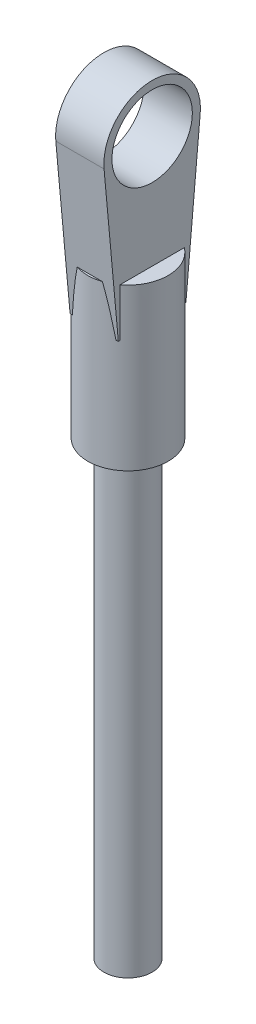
ISO-10303-21;
HEADER;
FILE_DESCRIPTION(('STEP AP214'),'2;1');
FILE_NAME('part.step','',(''),(''),'','','');
FILE_SCHEMA(('AUTOMOTIVE_DESIGN { 1 0 10303 214 1 1 1 1 }'));
ENDSEC;
DATA;
#1=APPLICATION_CONTEXT('core data for automotive mechanical design processes');
#2=APPLICATION_PROTOCOL_DEFINITION('international standard','automotive_design',2000,#1);
#3=PRODUCT_CONTEXT('',#1,'mechanical');
#4=PRODUCT('Part','Part','',(#3));
#5=PRODUCT_RELATED_PRODUCT_CATEGORY('part','',(#4));
#6=PRODUCT_DEFINITION_FORMATION('','',#4);
#7=PRODUCT_DEFINITION_CONTEXT('part definition',#1,'design');
#8=PRODUCT_DEFINITION('design','',#6,#7);
#9=PRODUCT_DEFINITION_SHAPE('','',#8);
#10=(LENGTH_UNIT() NAMED_UNIT(*) SI_UNIT(.MILLI.,.METRE.));
#11=(NAMED_UNIT(*) PLANE_ANGLE_UNIT() SI_UNIT($,.RADIAN.));
#12=(NAMED_UNIT(*) SI_UNIT($,.STERADIAN.) SOLID_ANGLE_UNIT());
#13=UNCERTAINTY_MEASURE_WITH_UNIT(LENGTH_MEASURE(1.E-05),#10,'distance_accuracy_value','');
#14=(GEOMETRIC_REPRESENTATION_CONTEXT(3) GLOBAL_UNCERTAINTY_ASSIGNED_CONTEXT((#13)) GLOBAL_UNIT_ASSIGNED_CONTEXT((#10,
#11,#12)) REPRESENTATION_CONTEXT('',''));
#15=CARTESIAN_POINT('',(0.,0.,0.));
#16=DIRECTION('',(0.,0.,1.));
#17=DIRECTION('',(1.,0.,0.));
#18=AXIS2_PLACEMENT_3D('',#15,#16,#17);
#19=CARTESIAN_POINT('',(0.,10.,0.));
#20=DIRECTION('',(0.,1.,0.));
#21=DIRECTION('',(0.,0.,1.));
#22=AXIS2_PLACEMENT_3D('',#19,#20,#21);
#23=PLANE('',#22);
#24=DIRECTION('',(-1.,0.,0.));
#25=VECTOR('',#24,1.);
#26=CARTESIAN_POINT('',(0.,10.,-2.37373888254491));
#27=LINE('',#26,#25);
#28=CARTESIAN_POINT('',(0.784451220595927,10.,-2.37373888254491));
#29=VERTEX_POINT('',#28);
#30=CARTESIAN_POINT('',(-0.784451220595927,10.,-2.37373888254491));
#31=VERTEX_POINT('',#30);
#32=EDGE_CURVE('E219',#29,#31,#27,.T.);
#33=ORIENTED_EDGE('',*,*,#32,.F.);
#34=CARTESIAN_POINT('',(0.,10.,0.));
#35=DIRECTION('',(0.,1.,0.));
#36=DIRECTION('',(0.,0.,1.));
#37=AXIS2_PLACEMENT_3D('',#34,#35,#36);
#38=CIRCLE('',#37,2.5);
#39=EDGE_CURVE('E439',#29,#31,#38,.T.);
#40=ORIENTED_EDGE('',*,*,#39,.T.);
#41=EDGE_LOOP('',(#33,#40));
#42=FACE_BOUND('',#41,.T.);
#43=ADVANCED_FACE('F36',(#42),#23,.T.);
#44=CARTESIAN_POINT('',(-1.5,10.,-2.));
#45=VERTEX_POINT('',#44);
#46=CARTESIAN_POINT('',(-1.5,10.,2.));
#47=VERTEX_POINT('',#46);
#48=EDGE_CURVE('E208',#45,#47,#38,.T.);
#49=ORIENTED_EDGE('',*,*,#48,.T.);
#50=DIRECTION('',(0.,0.,-1.));
#51=VECTOR('',#50,1.);
#52=CARTESIAN_POINT('',(-1.5,10.,0.));
#53=LINE('',#52,#51);
#54=EDGE_CURVE('E215',#47,#45,#53,.T.);
#55=ORIENTED_EDGE('',*,*,#54,.T.);
#56=EDGE_LOOP('',(#49,#55));
#57=FACE_BOUND('',#56,.T.);
#58=ADVANCED_FACE('F259',(#57),#23,.T.);
#59=DIRECTION('',(1.,0.,0.));
#60=VECTOR('',#59,1.);
#61=CARTESIAN_POINT('',(0.,10.,2.37373888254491));
#62=LINE('',#61,#60);
#63=CARTESIAN_POINT('',(-0.784451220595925,10.,2.37373888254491));
#64=VERTEX_POINT('',#63);
#65=CARTESIAN_POINT('',(0.784451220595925,10.,2.37373888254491));
#66=VERTEX_POINT('',#65);
#67=EDGE_CURVE('E217',#64,#66,#62,.T.);
#68=ORIENTED_EDGE('',*,*,#67,.F.);
#69=EDGE_CURVE('E205',#64,#66,#38,.T.);
#70=ORIENTED_EDGE('',*,*,#69,.T.);
#71=EDGE_LOOP('',(#68,#70));
#72=FACE_BOUND('',#71,.T.);
#73=ADVANCED_FACE('F266',(#72),#23,.T.);
#74=CARTESIAN_POINT('',(0.,10.,0.));
#75=DIRECTION('',(0.,-1.,0.));
#76=DIRECTION('',(0.,0.,-1.));
#77=AXIS2_PLACEMENT_3D('',#74,#75,#76);
#78=CYLINDRICAL_SURFACE('',#77,2.5);
#79=ORIENTED_EDGE('',*,*,#69,.F.);
#80=CARTESIAN_POINT('',(0.,-16.0146332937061,0.));
#81=DIRECTION('',(0.,-0.0908687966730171,0.995862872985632));
#82=DIRECTION('',(0.,-0.995862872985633,-0.0908687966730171));
#83=AXIS2_PLACEMENT_3D('',#80,#81,#82);
#84=ELLIPSE('',#83,27.5121944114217,2.5);
#85=CARTESIAN_POINT('',(-1.35646599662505,7.,2.1));
#86=VERTEX_POINT('',#85);
#87=EDGE_CURVE('E51',#64,#86,#84,.T.);
#88=ORIENTED_EDGE('',*,*,#87,.T.);
#89=CARTESIAN_POINT('',(0.,7.,0.));
#90=DIRECTION('',(0.,-1.,0.));
#91=DIRECTION('',(0.,0.,-1.));
#92=AXIS2_PLACEMENT_3D('',#89,#90,#91);
#93=CIRCLE('',#92,2.5);
#94=CARTESIAN_POINT('',(-1.5,7.,2.));
#95=VERTEX_POINT('',#94);
#96=EDGE_CURVE('E11',#86,#95,#93,.T.);
#97=ORIENTED_EDGE('',*,*,#96,.T.);
#98=DIRECTION('',(0.,-1.,0.));
#99=VECTOR('',#98,1.);
#100=CARTESIAN_POINT('',(-1.5,10.,2.));
#101=LINE('',#100,#99);
#102=EDGE_CURVE('E191',#47,#95,#101,.T.);
#103=ORIENTED_EDGE('',*,*,#102,.F.);
#104=ORIENTED_EDGE('',*,*,#48,.F.);
#105=DIRECTION('',(0.,-1.,0.));
#106=VECTOR('',#105,1.);
#107=CARTESIAN_POINT('',(-1.5,10.,-2.));
#108=LINE('',#107,#106);
#109=CARTESIAN_POINT('',(-1.5,7.,-2.));
#110=VERTEX_POINT('',#109);
#111=EDGE_CURVE('E188',#110,#45,#108,.F.);
#112=ORIENTED_EDGE('',*,*,#111,.F.);
#113=CARTESIAN_POINT('',(-1.35646599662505,7.,-2.1));
#114=VERTEX_POINT('',#113);
#115=EDGE_CURVE('E45',#110,#114,#93,.T.);
#116=ORIENTED_EDGE('',*,*,#115,.T.);
#117=CARTESIAN_POINT('',(0.,-16.0146332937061,0.));
#118=DIRECTION('',(0.,-0.0908687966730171,-0.995862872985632));
#119=DIRECTION('',(0.,-0.995862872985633,0.0908687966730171));
#120=AXIS2_PLACEMENT_3D('',#117,#118,#119);
#121=ELLIPSE('',#120,27.5121944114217,2.5);
#122=EDGE_CURVE('E197',#114,#31,#121,.T.);
#123=ORIENTED_EDGE('',*,*,#122,.T.);
#124=ORIENTED_EDGE('',*,*,#39,.F.);
#125=CARTESIAN_POINT('',(1.35646599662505,7.,-2.1));
#126=VERTEX_POINT('',#125);
#127=EDGE_CURVE('E195',#29,#126,#121,.T.);
#128=ORIENTED_EDGE('',*,*,#127,.T.);
#129=CARTESIAN_POINT('',(1.5,7.,-2.));
#130=VERTEX_POINT('',#129);
#131=EDGE_CURVE('E40',#126,#130,#93,.T.);
#132=ORIENTED_EDGE('',*,*,#131,.T.);
#133=DIRECTION('',(0.,-1.,0.));
#134=VECTOR('',#133,1.);
#135=CARTESIAN_POINT('',(1.5,10.,-2.));
#136=LINE('',#135,#134);
#137=CARTESIAN_POINT('',(1.5,10.,-2.));
#138=VERTEX_POINT('',#137);
#139=EDGE_CURVE('E177',#130,#138,#136,.F.);
#140=ORIENTED_EDGE('',*,*,#139,.T.);
#141=CARTESIAN_POINT('',(1.5,10.,2.));
#142=VERTEX_POINT('',#141);
#143=EDGE_CURVE('E209',#142,#138,#38,.T.);
#144=ORIENTED_EDGE('',*,*,#143,.F.);
#145=DIRECTION('',(0.,-1.,0.));
#146=VECTOR('',#145,1.);
#147=CARTESIAN_POINT('',(1.5,10.,2.));
#148=LINE('',#147,#146);
#149=CARTESIAN_POINT('',(1.5,7.,2.));
#150=VERTEX_POINT('',#149);
#151=EDGE_CURVE('E186',#142,#150,#148,.T.);
#152=ORIENTED_EDGE('',*,*,#151,.T.);
#153=CARTESIAN_POINT('',(1.35646599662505,7.,2.1));
#154=VERTEX_POINT('',#153);
#155=EDGE_CURVE('E222',#150,#154,#93,.T.);
#156=ORIENTED_EDGE('',*,*,#155,.T.);
#157=EDGE_CURVE('E194',#154,#66,#84,.T.);
#158=ORIENTED_EDGE('',*,*,#157,.T.);
#159=EDGE_LOOP('',(#79,#88,#97,#103,#104,#112,#116,#123,#124,#128,#132,#140,#144,#152,#156,#158));
#160=FACE_BOUND('',#159,.T.);
#161=CARTESIAN_POINT('',(0.,0.,0.));
#162=DIRECTION('',(0.,1.,0.));
#163=DIRECTION('',(0.,0.,1.));
#164=AXIS2_PLACEMENT_3D('',#161,#162,#163);
#165=CIRCLE('',#164,2.5);
#166=CARTESIAN_POINT('',(0.,0.,2.5));
#167=VERTEX_POINT('',#166);
#168=EDGE_CURVE('E201',#167,#167,#165,.T.);
#169=ORIENTED_EDGE('',*,*,#168,.T.);
#170=EDGE_LOOP('',(#169));
#171=FACE_BOUND('',#170,.T.);
#172=ADVANCED_FACE('F38',(#160,#171),#78,.T.);
#173=DIRECTION('',(0.,0.,-1.));
#174=VECTOR('',#173,1.);
#175=CARTESIAN_POINT('',(1.5,10.,0.));
#176=LINE('',#175,#174);
#177=EDGE_CURVE('E212',#142,#138,#176,.T.);
#178=ORIENTED_EDGE('',*,*,#177,.F.);
#179=ORIENTED_EDGE('',*,*,#143,.T.);
#180=EDGE_LOOP('',(#178,#179));
#181=FACE_BOUND('',#180,.T.);
#182=ADVANCED_FACE('F262',(#181),#23,.T.);
#183=CARTESIAN_POINT('',(0.,0.,0.));
#184=DIRECTION('',(0.,1.,0.));
#185=DIRECTION('',(0.,0.,1.));
#186=AXIS2_PLACEMENT_3D('',#183,#184,#185);
#187=PLANE('',#186);
#188=CARTESIAN_POINT('',(0.,0.,0.));
#189=DIRECTION('',(0.,1.,0.));
#190=DIRECTION('',(0.,0.,1.));
#191=AXIS2_PLACEMENT_3D('',#188,#189,#190);
#192=CIRCLE('',#191,1.5);
#193=CARTESIAN_POINT('',(0.,0.,1.5));
#194=VERTEX_POINT('',#193);
#195=EDGE_CURVE('E202',#194,#194,#192,.T.);
#196=ORIENTED_EDGE('',*,*,#195,.T.);
#197=EDGE_LOOP('',(#196));
#198=FACE_BOUND('',#197,.T.);
#199=ORIENTED_EDGE('',*,*,#168,.F.);
#200=EDGE_LOOP('',(#199));
#201=FACE_BOUND('',#200,.T.);
#202=ADVANCED_FACE('F270',(#198,#201),#187,.F.);
#203=CARTESIAN_POINT('',(0.,-28.,0.));
#204=DIRECTION('',(0.,1.,0.));
#205=DIRECTION('',(0.,0.,1.));
#206=AXIS2_PLACEMENT_3D('',#203,#204,#205);
#207=CYLINDRICAL_SURFACE('',#206,1.5);
#208=CARTESIAN_POINT('',(0.,-28.,0.));
#209=DIRECTION('',(0.,1.,0.));
#210=DIRECTION('',(0.,0.,1.));
#211=AXIS2_PLACEMENT_3D('',#208,#209,#210);
#212=CIRCLE('',#211,1.5);
#213=CARTESIAN_POINT('',(0.,-28.,1.5));
#214=VERTEX_POINT('',#213);
#215=EDGE_CURVE('E198',#214,#214,#212,.T.);
#216=ORIENTED_EDGE('',*,*,#215,.T.);
#217=EDGE_LOOP('',(#216));
#218=FACE_BOUND('',#217,.T.);
#219=ORIENTED_EDGE('',*,*,#195,.F.);
#220=EDGE_LOOP('',(#219));
#221=FACE_BOUND('',#220,.T.);
#222=ADVANCED_FACE('F276',(#218,#221),#207,.T.);
#223=CARTESIAN_POINT('',(0.,-28.,0.));
#224=DIRECTION('',(0.,1.,0.));
#225=DIRECTION('',(0.,0.,1.));
#226=AXIS2_PLACEMENT_3D('',#223,#224,#225);
#227=PLANE('',#226);
#228=ORIENTED_EDGE('',*,*,#215,.F.);
#229=EDGE_LOOP('',(#228));
#230=FACE_BOUND('',#229,.T.);
#231=ADVANCED_FACE('F254',(#230),#227,.F.);
#232=CARTESIAN_POINT('',(-1.5,7.,0.));
#233=DIRECTION('',(0.,-1.,0.));
#234=DIRECTION('',(0.,0.,-1.));
#235=AXIS2_PLACEMENT_3D('',#232,#233,#234);
#236=PLANE('',#235);
#237=ORIENTED_EDGE('',*,*,#131,.F.);
#238=DIRECTION('',(1.,0.,0.));
#239=VECTOR('',#238,1.);
#240=CARTESIAN_POINT('',(-1.5,7.,-2.1));
#241=LINE('',#240,#239);
#242=CARTESIAN_POINT('',(1.5,7.,-2.1));
#243=VERTEX_POINT('',#242);
#244=EDGE_CURVE('E178',#126,#243,#241,.T.);
#245=ORIENTED_EDGE('',*,*,#244,.T.);
#246=DIRECTION('',(0.,0.,-1.));
#247=VECTOR('',#246,1.);
#248=CARTESIAN_POINT('',(1.5,7.,0.));
#249=LINE('',#248,#247);
#250=EDGE_CURVE('E152',#130,#243,#249,.T.);
#251=ORIENTED_EDGE('',*,*,#250,.F.);
#252=EDGE_LOOP('',(#237,#245,#251));
#253=FACE_BOUND('',#252,.T.);
#254=ADVANCED_FACE('F247',(#253),#236,.T.);
#255=ORIENTED_EDGE('',*,*,#155,.F.);
#256=CARTESIAN_POINT('',(1.5,7.,2.1));
#257=VERTEX_POINT('',#256);
#258=EDGE_CURVE('E156',#257,#150,#249,.T.);
#259=ORIENTED_EDGE('',*,*,#258,.F.);
#260=DIRECTION('',(1.,0.,0.));
#261=VECTOR('',#260,1.);
#262=CARTESIAN_POINT('',(-1.5,7.,2.1));
#263=LINE('',#262,#261);
#264=EDGE_CURVE('E182',#154,#257,#263,.T.);
#265=ORIENTED_EDGE('',*,*,#264,.F.);
#266=EDGE_LOOP('',(#255,#259,#265));
#267=FACE_BOUND('',#266,.T.);
#268=ADVANCED_FACE('F244',(#267),#236,.T.);
#269=ORIENTED_EDGE('',*,*,#96,.F.);
#270=CARTESIAN_POINT('',(-1.5,7.,2.1));
#271=VERTEX_POINT('',#270);
#272=EDGE_CURVE('E179',#271,#86,#263,.T.);
#273=ORIENTED_EDGE('',*,*,#272,.F.);
#274=DIRECTION('',(0.,0.,-1.));
#275=VECTOR('',#274,1.);
#276=CARTESIAN_POINT('',(-1.5,7.,0.));
#277=LINE('',#276,#275);
#278=EDGE_CURVE('E169',#271,#95,#277,.T.);
#279=ORIENTED_EDGE('',*,*,#278,.T.);
#280=EDGE_LOOP('',(#269,#273,#279));
#281=FACE_BOUND('',#280,.T.);
#282=ADVANCED_FACE('F246',(#281),#236,.T.);
#283=ORIENTED_EDGE('',*,*,#115,.F.);
#284=CARTESIAN_POINT('',(-1.5,7.,-2.1));
#285=VERTEX_POINT('',#284);
#286=EDGE_CURVE('E168',#110,#285,#277,.T.);
#287=ORIENTED_EDGE('',*,*,#286,.T.);
#288=EDGE_CURVE('E174',#285,#114,#241,.T.);
#289=ORIENTED_EDGE('',*,*,#288,.T.);
#290=EDGE_LOOP('',(#283,#287,#289));
#291=FACE_BOUND('',#290,.T.);
#292=ADVANCED_FACE('F233',(#291),#236,.T.);
#293=CARTESIAN_POINT('',(-1.5,-0.132235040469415,-1.44920998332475));
#294=DIRECTION('',(0.,-0.0908687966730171,-0.995862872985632));
#295=DIRECTION('',(0.,0.995862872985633,-0.0908687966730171));
#296=AXIS2_PLACEMENT_3D('',#293,#294,#295);
#297=PLANE('',#296);
#298=ORIENTED_EDGE('',*,*,#122,.F.);
#299=ORIENTED_EDGE('',*,*,#288,.F.);
#300=DIRECTION('',(0.,0.995862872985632,-0.0908687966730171));
#301=VECTOR('',#300,1.);
#302=CARTESIAN_POINT('',(-1.5,-0.132235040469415,-1.44920998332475));
#303=LINE('',#302,#301);
#304=CARTESIAN_POINT('',(-1.5,16.727393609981,-2.9875886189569));
#305=VERTEX_POINT('',#304);
#306=EDGE_CURVE('E132',#285,#305,#303,.T.);
#307=ORIENTED_EDGE('',*,*,#306,.T.);
#308=DIRECTION('',(1.,0.,0.));
#309=VECTOR('',#308,1.);
#310=CARTESIAN_POINT('',(-1.5,16.727393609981,-2.9875886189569));
#311=LINE('',#310,#309);
#312=CARTESIAN_POINT('',(1.5,16.727393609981,-2.9875886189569));
#313=VERTEX_POINT('',#312);
#314=EDGE_CURVE('E123',#305,#313,#311,.T.);
#315=ORIENTED_EDGE('',*,*,#314,.T.);
#316=DIRECTION('',(0.,0.995862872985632,-0.0908687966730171));
#317=VECTOR('',#316,1.);
#318=CARTESIAN_POINT('',(1.5,-0.132235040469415,-1.44920998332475));
#319=LINE('',#318,#317);
#320=EDGE_CURVE('E129',#243,#313,#319,.T.);
#321=ORIENTED_EDGE('',*,*,#320,.F.);
#322=ORIENTED_EDGE('',*,*,#244,.F.);
#323=ORIENTED_EDGE('',*,*,#127,.F.);
#324=ORIENTED_EDGE('',*,*,#32,.T.);
#325=EDGE_LOOP('',(#298,#299,#307,#315,#321,#322,#323,#324));
#326=FACE_BOUND('',#325,.T.);
#327=ADVANCED_FACE('F126',(#326),#297,.T.);
#328=CARTESIAN_POINT('',(-1.5,-0.132235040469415,1.44920998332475));
#329=DIRECTION('',(0.,-0.0908687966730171,0.995862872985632));
#330=DIRECTION('',(0.,-0.995862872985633,-0.0908687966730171));
#331=AXIS2_PLACEMENT_3D('',#328,#329,#330);
#332=PLANE('',#331);
#333=ORIENTED_EDGE('',*,*,#157,.F.);
#334=ORIENTED_EDGE('',*,*,#264,.T.);
#335=DIRECTION('',(0.,-0.995862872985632,-0.0908687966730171));
#336=VECTOR('',#335,1.);
#337=CARTESIAN_POINT('',(1.5,-0.132235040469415,1.44920998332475));
#338=LINE('',#337,#336);
#339=CARTESIAN_POINT('',(1.5,16.727393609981,2.9875886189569));
#340=VERTEX_POINT('',#339);
#341=EDGE_CURVE('E145',#340,#257,#338,.T.);
#342=ORIENTED_EDGE('',*,*,#341,.F.);
#343=DIRECTION('',(1.,0.,0.));
#344=VECTOR('',#343,1.);
#345=CARTESIAN_POINT('',(-1.5,16.727393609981,2.9875886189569));
#346=LINE('',#345,#344);
#347=CARTESIAN_POINT('',(-1.5,16.727393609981,2.9875886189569));
#348=VERTEX_POINT('',#347);
#349=EDGE_CURVE('E136',#348,#340,#346,.T.);
#350=ORIENTED_EDGE('',*,*,#349,.F.);
#351=DIRECTION('',(0.,-0.995862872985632,-0.0908687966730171));
#352=VECTOR('',#351,1.);
#353=CARTESIAN_POINT('',(-1.5,-0.132235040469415,1.44920998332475));
#354=LINE('',#353,#352);
#355=EDGE_CURVE('E165',#348,#271,#354,.T.);
#356=ORIENTED_EDGE('',*,*,#355,.T.);
#357=ORIENTED_EDGE('',*,*,#272,.T.);
#358=ORIENTED_EDGE('',*,*,#87,.F.);
#359=ORIENTED_EDGE('',*,*,#67,.T.);
#360=EDGE_LOOP('',(#333,#334,#342,#350,#356,#357,#358,#359));
#361=FACE_BOUND('',#360,.T.);
#362=ADVANCED_FACE('F240',(#361),#332,.T.);
#363=CARTESIAN_POINT('',(-1.5,0.,0.));
#364=DIRECTION('',(1.,0.,0.));
#365=DIRECTION('',(0.,0.,-1.));
#366=AXIS2_PLACEMENT_3D('',#363,#364,#365);
#367=PLANE('',#366);
#368=CARTESIAN_POINT('',(-1.5,17.,0.));
#369=DIRECTION('',(1.,0.,0.));
#370=DIRECTION('',(0.,0.,-1.));
#371=AXIS2_PLACEMENT_3D('',#368,#369,#370);
#372=CIRCLE('',#371,2.5);
#373=CARTESIAN_POINT('',(-1.5,17.,-2.5));
#374=VERTEX_POINT('',#373);
#375=EDGE_CURVE('E137',#374,#374,#372,.T.);
#376=ORIENTED_EDGE('',*,*,#375,.T.);
#377=EDGE_LOOP('',(#376));
#378=FACE_BOUND('',#377,.T.);
#379=ORIENTED_EDGE('',*,*,#54,.F.);
#380=ORIENTED_EDGE('',*,*,#102,.T.);
#381=ORIENTED_EDGE('',*,*,#278,.F.);
#382=ORIENTED_EDGE('',*,*,#355,.F.);
#383=CARTESIAN_POINT('',(-1.5,17.,0.));
#384=DIRECTION('',(1.,0.,0.));
#385=DIRECTION('',(0.,0.,-1.));
#386=AXIS2_PLACEMENT_3D('',#383,#384,#385);
#387=CIRCLE('',#386,3.);
#388=EDGE_CURVE('E163',#305,#348,#387,.T.);
#389=ORIENTED_EDGE('',*,*,#388,.F.);
#390=ORIENTED_EDGE('',*,*,#306,.F.);
#391=ORIENTED_EDGE('',*,*,#286,.F.);
#392=ORIENTED_EDGE('',*,*,#111,.T.);
#393=EDGE_LOOP('',(#379,#380,#381,#382,#389,#390,#391,#392));
#394=FACE_BOUND('',#393,.T.);
#395=ADVANCED_FACE('F236',(#378,#394),#367,.F.);
#396=CARTESIAN_POINT('',(1.5,0.,0.));
#397=DIRECTION('',(1.,0.,0.));
#398=DIRECTION('',(0.,0.,-1.));
#399=AXIS2_PLACEMENT_3D('',#396,#397,#398);
#400=PLANE('',#399);
#401=CARTESIAN_POINT('',(1.5,17.,0.));
#402=DIRECTION('',(1.,0.,0.));
#403=DIRECTION('',(0.,0.,-1.));
#404=AXIS2_PLACEMENT_3D('',#401,#402,#403);
#405=CIRCLE('',#404,2.5);
#406=CARTESIAN_POINT('',(1.5,17.,-2.5));
#407=VERTEX_POINT('',#406);
#408=EDGE_CURVE('E159',#407,#407,#405,.T.);
#409=ORIENTED_EDGE('',*,*,#408,.F.);
#410=EDGE_LOOP('',(#409));
#411=FACE_BOUND('',#410,.T.);
#412=ORIENTED_EDGE('',*,*,#151,.F.);
#413=ORIENTED_EDGE('',*,*,#177,.T.);
#414=ORIENTED_EDGE('',*,*,#139,.F.);
#415=ORIENTED_EDGE('',*,*,#250,.T.);
#416=ORIENTED_EDGE('',*,*,#320,.T.);
#417=CARTESIAN_POINT('',(1.5,17.,0.));
#418=DIRECTION('',(1.,0.,0.));
#419=DIRECTION('',(0.,0.,-1.));
#420=AXIS2_PLACEMENT_3D('',#417,#418,#419);
#421=CIRCLE('',#420,3.);
#422=EDGE_CURVE('E140',#313,#340,#421,.T.);
#423=ORIENTED_EDGE('',*,*,#422,.T.);
#424=ORIENTED_EDGE('',*,*,#341,.T.);
#425=ORIENTED_EDGE('',*,*,#258,.T.);
#426=EDGE_LOOP('',(#412,#413,#414,#415,#416,#423,#424,#425));
#427=FACE_BOUND('',#426,.T.);
#428=ADVANCED_FACE('F149',(#411,#427),#400,.T.);
#429=CARTESIAN_POINT('',(-1.5,17.,0.));
#430=DIRECTION('',(1.,0.,0.));
#431=DIRECTION('',(0.,0.,-1.));
#432=AXIS2_PLACEMENT_3D('',#429,#430,#431);
#433=CYLINDRICAL_SURFACE('',#432,3.);
#434=ORIENTED_EDGE('',*,*,#349,.T.);
#435=ORIENTED_EDGE('',*,*,#422,.F.);
#436=ORIENTED_EDGE('',*,*,#314,.F.);
#437=ORIENTED_EDGE('',*,*,#388,.T.);
#438=EDGE_LOOP('',(#434,#435,#436,#437));
#439=FACE_BOUND('',#438,.T.);
#440=ADVANCED_FACE('F141',(#439),#433,.T.);
#441=CARTESIAN_POINT('',(-1.5,17.,0.));
#442=DIRECTION('',(1.,0.,0.));
#443=DIRECTION('',(0.,0.,-1.));
#444=AXIS2_PLACEMENT_3D('',#441,#442,#443);
#445=CYLINDRICAL_SURFACE('',#444,2.5);
#446=ORIENTED_EDGE('',*,*,#375,.F.);
#447=EDGE_LOOP('',(#446));
#448=FACE_BOUND('',#447,.T.);
#449=ORIENTED_EDGE('',*,*,#408,.T.);
#450=EDGE_LOOP('',(#449));
#451=FACE_BOUND('',#450,.T.);
#452=ADVANCED_FACE('F324',(#448,#451),#445,.F.);
#453=CLOSED_SHELL('',(#43,#58,#73,#172,#182,#202,#222,#231,#254,#268,#282,#292,#327,#362,#395,
#428,#440,#452));
#454=MANIFOLD_SOLID_BREP('B2',#453);
#455=ADVANCED_BREP_SHAPE_REPRESENTATION('',(#18,#454),#14);
#456=SHAPE_DEFINITION_REPRESENTATION(#9,#455);
ENDSEC;
END-ISO-10303-21;
